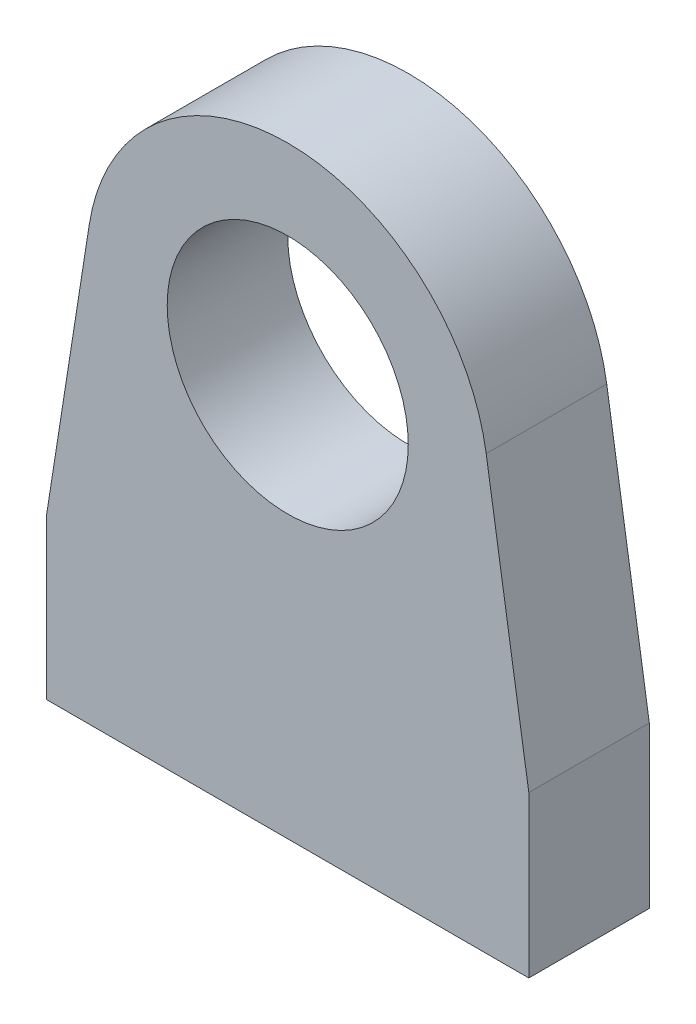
ISO-10303-21;
HEADER;
FILE_DESCRIPTION(('STEP AP214'),'2;1');
FILE_NAME('part.step','',(''),(''),'','','');
FILE_SCHEMA(('AUTOMOTIVE_DESIGN { 1 0 10303 214 1 1 1 1 }'));
ENDSEC;
DATA;
#1=APPLICATION_CONTEXT('core data for automotive mechanical design processes');
#2=APPLICATION_PROTOCOL_DEFINITION('international standard','automotive_design',2000,#1);
#3=PRODUCT_CONTEXT('',#1,'mechanical');
#4=PRODUCT('Part','Part','',(#3));
#5=PRODUCT_RELATED_PRODUCT_CATEGORY('part','',(#4));
#6=PRODUCT_DEFINITION_FORMATION('','',#4);
#7=PRODUCT_DEFINITION_CONTEXT('part definition',#1,'design');
#8=PRODUCT_DEFINITION('design','',#6,#7);
#9=PRODUCT_DEFINITION_SHAPE('','',#8);
#10=(LENGTH_UNIT() NAMED_UNIT(*) SI_UNIT(.MILLI.,.METRE.));
#11=(NAMED_UNIT(*) PLANE_ANGLE_UNIT() SI_UNIT($,.RADIAN.));
#12=(NAMED_UNIT(*) SI_UNIT($,.STERADIAN.) SOLID_ANGLE_UNIT());
#13=UNCERTAINTY_MEASURE_WITH_UNIT(LENGTH_MEASURE(1.E-05),#10,'distance_accuracy_value','');
#14=(GEOMETRIC_REPRESENTATION_CONTEXT(3) GLOBAL_UNCERTAINTY_ASSIGNED_CONTEXT((#13)) GLOBAL_UNIT_ASSIGNED_CONTEXT((#10,
#11,#12)) REPRESENTATION_CONTEXT('',''));
#15=CARTESIAN_POINT('',(0.,0.,0.));
#16=DIRECTION('',(0.,0.,1.));
#17=DIRECTION('',(1.,0.,0.));
#18=AXIS2_PLACEMENT_3D('',#15,#16,#17);
#19=CARTESIAN_POINT('',(0.,0.,15.));
#20=DIRECTION('',(0.,0.,1.));
#21=DIRECTION('',(1.,0.,0.));
#22=AXIS2_PLACEMENT_3D('',#19,#20,#21);
#23=PLANE('',#22);
#24=DIRECTION('',(0.,-1.,0.));
#25=VECTOR('',#24,1.);
#26=CARTESIAN_POINT('',(-30.,-30.,15.));
#27=LINE('',#26,#25);
#28=CARTESIAN_POINT('',(-30.,-30.,15.));
#29=VERTEX_POINT('',#28);
#30=CARTESIAN_POINT('',(-30.,-50.,15.));
#31=VERTEX_POINT('',#30);
#32=EDGE_CURVE('E148',#29,#31,#27,.T.);
#33=ORIENTED_EDGE('',*,*,#32,.T.);
#34=DIRECTION('',(1.,0.,0.));
#35=VECTOR('',#34,1.);
#36=CARTESIAN_POINT('',(-30.,-50.,15.));
#37=LINE('',#36,#35);
#38=CARTESIAN_POINT('',(30.,-50.,15.));
#39=VERTEX_POINT('',#38);
#40=EDGE_CURVE('E95',#31,#39,#37,.T.);
#41=ORIENTED_EDGE('',*,*,#40,.T.);
#42=DIRECTION('',(0.,1.,0.));
#43=VECTOR('',#42,1.);
#44=CARTESIAN_POINT('',(30.,-50.,15.));
#45=LINE('',#44,#43);
#46=CARTESIAN_POINT('',(30.,-30.,15.));
#47=VERTEX_POINT('',#46);
#48=EDGE_CURVE('E108',#39,#47,#45,.T.);
#49=ORIENTED_EDGE('',*,*,#48,.T.);
#50=DIRECTION('',(-0.154637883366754,0.987971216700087,0.));
#51=VECTOR('',#50,1.);
#52=CARTESIAN_POINT('',(30.,-30.,15.));
#53=LINE('',#52,#51);
#54=CARTESIAN_POINT('',(24.6992804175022,3.86594708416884,15.));
#55=VERTEX_POINT('',#54);
#56=EDGE_CURVE('E102',#47,#55,#53,.T.);
#57=ORIENTED_EDGE('',*,*,#56,.T.);
#58=CARTESIAN_POINT('',(0.,0.,15.));
#59=DIRECTION('',(0.,0.,1.));
#60=DIRECTION('',(1.,0.,0.));
#61=AXIS2_PLACEMENT_3D('',#58,#59,#60);
#62=CIRCLE('',#61,25.);
#63=CARTESIAN_POINT('',(-24.6992804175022,3.86594708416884,15.));
#64=VERTEX_POINT('',#63);
#65=EDGE_CURVE('E106',#55,#64,#62,.T.);
#66=ORIENTED_EDGE('',*,*,#65,.T.);
#67=DIRECTION('',(-0.154637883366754,-0.987971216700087,0.));
#68=VECTOR('',#67,1.);
#69=CARTESIAN_POINT('',(-24.6992804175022,3.86594708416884,15.));
#70=LINE('',#69,#68);
#71=EDGE_CURVE('E58',#64,#29,#70,.T.);
#72=ORIENTED_EDGE('',*,*,#71,.T.);
#73=EDGE_LOOP('',(#33,#41,#49,#57,#66,#72));
#74=FACE_BOUND('',#73,.T.);
#75=CARTESIAN_POINT('',(0.,0.,15.));
#76=DIRECTION('',(0.,0.,1.));
#77=DIRECTION('',(1.,0.,0.));
#78=AXIS2_PLACEMENT_3D('',#75,#76,#77);
#79=CIRCLE('',#78,15.);
#80=CARTESIAN_POINT('',(15.,0.,15.));
#81=VERTEX_POINT('',#80);
#82=EDGE_CURVE('E136',#81,#81,#79,.T.);
#83=ORIENTED_EDGE('',*,*,#82,.F.);
#84=EDGE_LOOP('',(#83));
#85=FACE_BOUND('',#84,.T.);
#86=ADVANCED_FACE('F40',(#74,#85),#23,.T.);
#87=CARTESIAN_POINT('',(0.,0.,0.));
#88=DIRECTION('',(0.,0.,1.));
#89=DIRECTION('',(1.,0.,0.));
#90=AXIS2_PLACEMENT_3D('',#87,#88,#89);
#91=PLANE('',#90);
#92=DIRECTION('',(0.,-1.,0.));
#93=VECTOR('',#92,1.);
#94=CARTESIAN_POINT('',(-30.,-30.,0.));
#95=LINE('',#94,#93);
#96=CARTESIAN_POINT('',(-30.,-30.,0.));
#97=VERTEX_POINT('',#96);
#98=CARTESIAN_POINT('',(-30.,-50.,0.));
#99=VERTEX_POINT('',#98);
#100=EDGE_CURVE('E131',#97,#99,#95,.T.);
#101=ORIENTED_EDGE('',*,*,#100,.F.);
#102=DIRECTION('',(-0.154637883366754,-0.987971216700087,0.));
#103=VECTOR('',#102,1.);
#104=CARTESIAN_POINT('',(-24.6992804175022,3.86594708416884,0.));
#105=LINE('',#104,#103);
#106=CARTESIAN_POINT('',(-24.6992804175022,3.86594708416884,0.));
#107=VERTEX_POINT('',#106);
#108=EDGE_CURVE('E87',#107,#97,#105,.T.);
#109=ORIENTED_EDGE('',*,*,#108,.F.);
#110=CARTESIAN_POINT('',(0.,0.,0.));
#111=DIRECTION('',(0.,0.,1.));
#112=DIRECTION('',(1.,0.,0.));
#113=AXIS2_PLACEMENT_3D('',#110,#111,#112);
#114=CIRCLE('',#113,25.);
#115=CARTESIAN_POINT('',(24.6992804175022,3.86594708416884,0.));
#116=VERTEX_POINT('',#115);
#117=EDGE_CURVE('E81',#116,#107,#114,.T.);
#118=ORIENTED_EDGE('',*,*,#117,.F.);
#119=DIRECTION('',(-0.154637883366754,0.987971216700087,0.));
#120=VECTOR('',#119,1.);
#121=CARTESIAN_POINT('',(30.,-30.,0.));
#122=LINE('',#121,#120);
#123=CARTESIAN_POINT('',(30.,-30.,0.));
#124=VERTEX_POINT('',#123);
#125=EDGE_CURVE('E117',#124,#116,#122,.T.);
#126=ORIENTED_EDGE('',*,*,#125,.F.);
#127=DIRECTION('',(0.,1.,0.));
#128=VECTOR('',#127,1.);
#129=CARTESIAN_POINT('',(30.,-50.,0.));
#130=LINE('',#129,#128);
#131=CARTESIAN_POINT('',(30.,-50.,0.));
#132=VERTEX_POINT('',#131);
#133=EDGE_CURVE('E139',#132,#124,#130,.T.);
#134=ORIENTED_EDGE('',*,*,#133,.F.);
#135=DIRECTION('',(1.,0.,0.));
#136=VECTOR('',#135,1.);
#137=CARTESIAN_POINT('',(-30.,-50.,0.));
#138=LINE('',#137,#136);
#139=EDGE_CURVE('E135',#99,#132,#138,.T.);
#140=ORIENTED_EDGE('',*,*,#139,.F.);
#141=EDGE_LOOP('',(#101,#109,#118,#126,#134,#140));
#142=FACE_BOUND('',#141,.T.);
#143=CARTESIAN_POINT('',(0.,0.,0.));
#144=DIRECTION('',(0.,0.,1.));
#145=DIRECTION('',(1.,0.,0.));
#146=AXIS2_PLACEMENT_3D('',#143,#144,#145);
#147=CIRCLE('',#146,15.);
#148=CARTESIAN_POINT('',(15.,0.,0.));
#149=VERTEX_POINT('',#148);
#150=EDGE_CURVE('E247',#149,#149,#147,.T.);
#151=ORIENTED_EDGE('',*,*,#150,.T.);
#152=EDGE_LOOP('',(#151));
#153=FACE_BOUND('',#152,.T.);
#154=ADVANCED_FACE('F163',(#142,#153),#91,.F.);
#155=CARTESIAN_POINT('',(-30.,-30.,15.));
#156=DIRECTION('',(1.,0.,0.));
#157=DIRECTION('',(0.,0.,-1.));
#158=AXIS2_PLACEMENT_3D('',#155,#156,#157);
#159=PLANE('',#158);
#160=ORIENTED_EDGE('',*,*,#100,.T.);
#161=DIRECTION('',(0.,0.,-1.));
#162=VECTOR('',#161,1.);
#163=CARTESIAN_POINT('',(-30.,-50.,15.));
#164=LINE('',#163,#162);
#165=EDGE_CURVE('E11',#31,#99,#164,.T.);
#166=ORIENTED_EDGE('',*,*,#165,.F.);
#167=ORIENTED_EDGE('',*,*,#32,.F.);
#168=DIRECTION('',(0.,0.,-1.));
#169=VECTOR('',#168,1.);
#170=CARTESIAN_POINT('',(-30.,-30.,15.));
#171=LINE('',#170,#169);
#172=EDGE_CURVE('E127',#29,#97,#171,.T.);
#173=ORIENTED_EDGE('',*,*,#172,.T.);
#174=EDGE_LOOP('',(#160,#166,#167,#173));
#175=FACE_BOUND('',#174,.T.);
#176=ADVANCED_FACE('F42',(#175),#159,.F.);
#177=CARTESIAN_POINT('',(-30.,-50.,15.));
#178=DIRECTION('',(0.,1.,0.));
#179=DIRECTION('',(0.,0.,1.));
#180=AXIS2_PLACEMENT_3D('',#177,#178,#179);
#181=PLANE('',#180);
#182=ORIENTED_EDGE('',*,*,#139,.T.);
#183=DIRECTION('',(0.,0.,-1.));
#184=VECTOR('',#183,1.);
#185=CARTESIAN_POINT('',(30.,-50.,15.));
#186=LINE('',#185,#184);
#187=EDGE_CURVE('E50',#39,#132,#186,.T.);
#188=ORIENTED_EDGE('',*,*,#187,.F.);
#189=ORIENTED_EDGE('',*,*,#40,.F.);
#190=ORIENTED_EDGE('',*,*,#165,.T.);
#191=EDGE_LOOP('',(#182,#188,#189,#190));
#192=FACE_BOUND('',#191,.T.);
#193=ADVANCED_FACE('F188',(#192),#181,.F.);
#194=CARTESIAN_POINT('',(30.,-50.,15.));
#195=DIRECTION('',(-1.,0.,0.));
#196=DIRECTION('',(0.,0.,1.));
#197=AXIS2_PLACEMENT_3D('',#194,#195,#196);
#198=PLANE('',#197);
#199=ORIENTED_EDGE('',*,*,#133,.T.);
#200=DIRECTION('',(0.,0.,-1.));
#201=VECTOR('',#200,1.);
#202=CARTESIAN_POINT('',(30.,-30.,15.));
#203=LINE('',#202,#201);
#204=EDGE_CURVE('E119',#47,#124,#203,.T.);
#205=ORIENTED_EDGE('',*,*,#204,.F.);
#206=ORIENTED_EDGE('',*,*,#48,.F.);
#207=ORIENTED_EDGE('',*,*,#187,.T.);
#208=EDGE_LOOP('',(#199,#205,#206,#207));
#209=FACE_BOUND('',#208,.T.);
#210=ADVANCED_FACE('F160',(#209),#198,.F.);
#211=CARTESIAN_POINT('',(30.,-30.,15.));
#212=DIRECTION('',(-0.987971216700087,-0.154637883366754,0.));
#213=DIRECTION('',(0.154637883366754,-0.987971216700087,0.));
#214=AXIS2_PLACEMENT_3D('',#211,#212,#213);
#215=PLANE('',#214);
#216=ORIENTED_EDGE('',*,*,#125,.T.);
#217=DIRECTION('',(0.,0.,-1.));
#218=VECTOR('',#217,1.);
#219=CARTESIAN_POINT('',(24.6992804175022,3.86594708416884,15.));
#220=LINE('',#219,#218);
#221=EDGE_CURVE('E114',#55,#116,#220,.T.);
#222=ORIENTED_EDGE('',*,*,#221,.F.);
#223=ORIENTED_EDGE('',*,*,#56,.F.);
#224=ORIENTED_EDGE('',*,*,#204,.T.);
#225=EDGE_LOOP('',(#216,#222,#223,#224));
#226=FACE_BOUND('',#225,.T.);
#227=ADVANCED_FACE('F115',(#226),#215,.F.);
#228=CARTESIAN_POINT('',(0.,0.,15.));
#229=DIRECTION('',(0.,0.,-1.));
#230=DIRECTION('',(-1.,0.,0.));
#231=AXIS2_PLACEMENT_3D('',#228,#229,#230);
#232=CYLINDRICAL_SURFACE('',#231,25.);
#233=ORIENTED_EDGE('',*,*,#117,.T.);
#234=DIRECTION('',(0.,0.,-1.));
#235=VECTOR('',#234,1.);
#236=CARTESIAN_POINT('',(-24.6992804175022,3.86594708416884,15.));
#237=LINE('',#236,#235);
#238=EDGE_CURVE('E120',#64,#107,#237,.T.);
#239=ORIENTED_EDGE('',*,*,#238,.F.);
#240=ORIENTED_EDGE('',*,*,#65,.F.);
#241=ORIENTED_EDGE('',*,*,#221,.T.);
#242=EDGE_LOOP('',(#233,#239,#240,#241));
#243=FACE_BOUND('',#242,.T.);
#244=ADVANCED_FACE('F122',(#243),#232,.T.);
#245=CARTESIAN_POINT('',(-24.6992804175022,3.86594708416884,15.));
#246=DIRECTION('',(0.987971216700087,-0.154637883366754,0.));
#247=DIRECTION('',(0.154637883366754,0.987971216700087,0.));
#248=AXIS2_PLACEMENT_3D('',#245,#246,#247);
#249=PLANE('',#248);
#250=ORIENTED_EDGE('',*,*,#108,.T.);
#251=ORIENTED_EDGE('',*,*,#172,.F.);
#252=ORIENTED_EDGE('',*,*,#71,.F.);
#253=ORIENTED_EDGE('',*,*,#238,.T.);
#254=EDGE_LOOP('',(#250,#251,#252,#253));
#255=FACE_BOUND('',#254,.T.);
#256=ADVANCED_FACE('F168',(#255),#249,.F.);
#257=CARTESIAN_POINT('',(0.,0.,15.));
#258=DIRECTION('',(0.,0.,-1.));
#259=DIRECTION('',(-1.,0.,0.));
#260=AXIS2_PLACEMENT_3D('',#257,#258,#259);
#261=CYLINDRICAL_SURFACE('',#260,15.);
#262=ORIENTED_EDGE('',*,*,#82,.T.);
#263=EDGE_LOOP('',(#262));
#264=FACE_BOUND('',#263,.T.);
#265=ORIENTED_EDGE('',*,*,#150,.F.);
#266=EDGE_LOOP('',(#265));
#267=FACE_BOUND('',#266,.T.);
#268=ADVANCED_FACE('F170',(#264,#267),#261,.F.);
#269=CLOSED_SHELL('',(#86,#154,#176,#193,#210,#227,#244,#256,#268));
#270=MANIFOLD_SOLID_BREP('B2',#269);
#271=ADVANCED_BREP_SHAPE_REPRESENTATION('',(#18,#270),#14);
#272=SHAPE_DEFINITION_REPRESENTATION(#9,#271);
ENDSEC;
END-ISO-10303-21;
